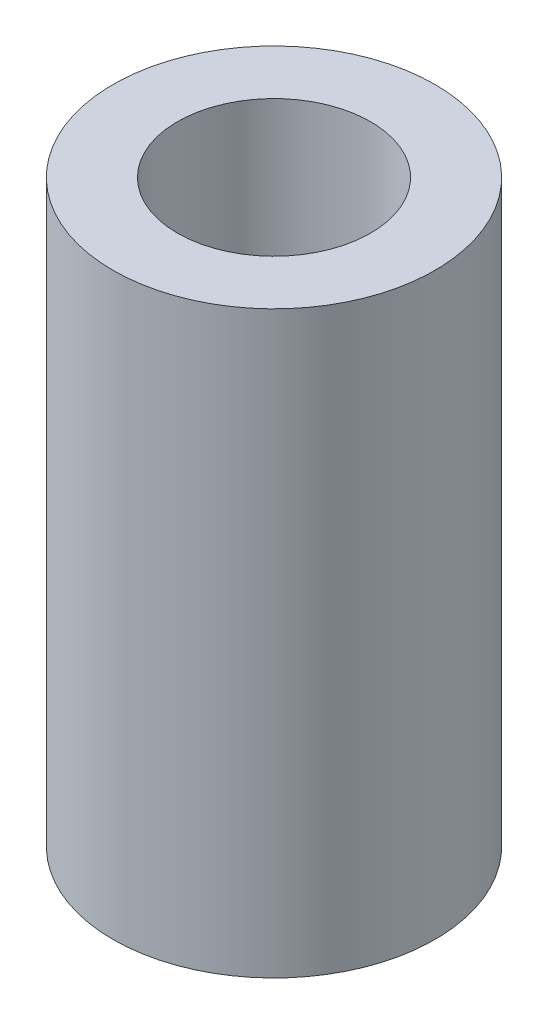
from build123d import *

# Parameters (mm, degrees)
ESBO_O1_R                     = 5
RESSALTO_EXTRUS_O1_DEPTH      = 3
ESBO_O2_R                     = 5
ESBO_O2_R_2                   = 3
RESSALTO_EXTRUS_O2_DEPTH      = 15
FURO_COM_FOLGA_DE_M2_51_D     = 2.9
FURO_COM_FOLGA_DE_M2_51_DEPTH = 4
FURO_COM_FOLGA_DE_M2_51_TIP   = 0.871247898


with BuildPart() as part:
    # Esbo_o1 → Ressalto-extrus_o1 (new body)
    with BuildSketch(Plane(origin=(0, 0, 0), x_dir=(1, 0, 0), z_dir=(0, 1, 0))):
        with Locations(Location((0, 0, 0), (0, 0, 270))):
            Circle(ESBO_O1_R)
    extrude(amount=RESSALTO_EXTRUS_O1_DEPTH)

    # Esbo_o2 → Ressalto-extrus_o2 (add)
    with BuildSketch(Plane(origin=(0, 3, 0), x_dir=(1, 0, 0), z_dir=(0, 1, 0))):
        with Locations(Location((0, 0, 0), (0, 0, 270))):
            Circle(ESBO_O2_R)
        with Locations(Location((0, 0, 0), (0, 0, 270))):
            Circle(ESBO_O2_R_2, mode=Mode.SUBTRACT)
    extrude(amount=RESSALTO_EXTRUS_O2_DEPTH)

    # Furo com folga de M2.51
    with Locations(Plane(origin=(0, 0, 0), x_dir=(0, 0, -1), z_dir=(0, -1, 0))):
        with Locations((0, 0)):
            Hole(FURO_COM_FOLGA_DE_M2_51_D / 2, depth=FURO_COM_FOLGA_DE_M2_51_DEPTH)
            with Locations((0, 0, -(FURO_COM_FOLGA_DE_M2_51_DEPTH + FURO_COM_FOLGA_DE_M2_51_TIP / 2))):  # 118° drill point
                Cone(0, FURO_COM_FOLGA_DE_M2_51_D / 2, FURO_COM_FOLGA_DE_M2_51_TIP, mode=Mode.SUBTRACT)


solid = part.part
